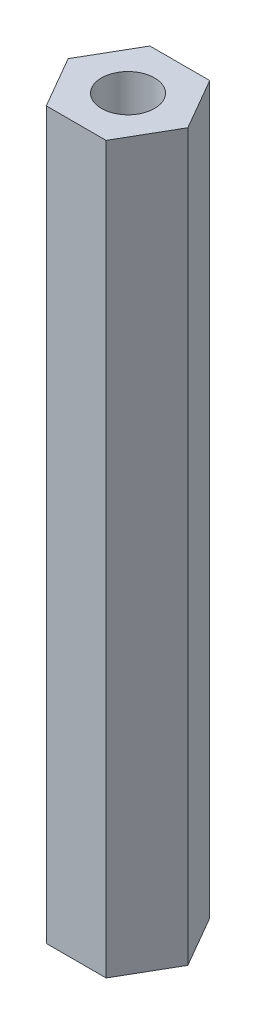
from build123d import *

# Parameters (mm, degrees)
SKETCH1_R           = 1.6256
BOSS_EXTRUDE1_DEPTH = 44.45


with BuildPart() as part:
    # Sketch1 → Boss-Extrude1 (new body)
    with BuildSketch(Plane(origin=(0, 0, 0), x_dir=(1, 0, 0), z_dir=(0, 1, 0))):
        Polygon((1.833087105, 3.175), (-1.833087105, 3.175), (-3.666174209, 0), (-1.833087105, -3.175), (1.833087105, -3.175), (3.666174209, 0), align=None)
        with Locations(Location((0, 0, 0), (0, 0, 270))):
            Circle(SKETCH1_R, mode=Mode.SUBTRACT)
    extrude(amount=BOSS_EXTRUDE1_DEPTH)


solid = part.part
